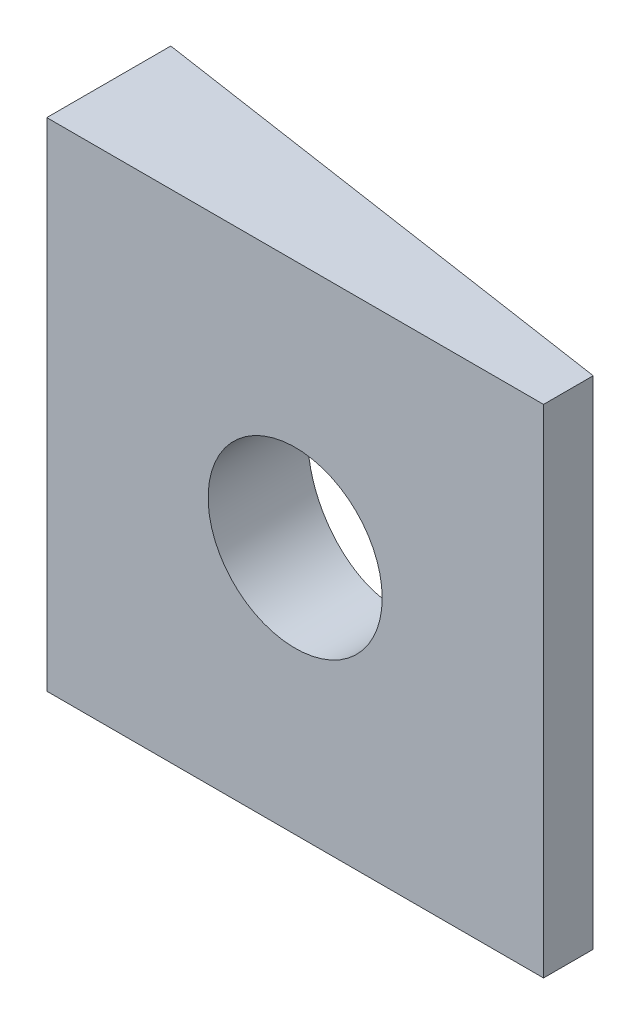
ISO-10303-21;
HEADER;
FILE_DESCRIPTION(('STEP AP214'),'2;1');
FILE_NAME('part.step','',(''),(''),'','','');
FILE_SCHEMA(('AUTOMOTIVE_DESIGN { 1 0 10303 214 1 1 1 1 }'));
ENDSEC;
DATA;
#1=APPLICATION_CONTEXT('core data for automotive mechanical design processes');
#2=APPLICATION_PROTOCOL_DEFINITION('international standard','automotive_design',2000,#1);
#3=PRODUCT_CONTEXT('',#1,'mechanical');
#4=PRODUCT('Part','Part','',(#3));
#5=PRODUCT_RELATED_PRODUCT_CATEGORY('part','',(#4));
#6=PRODUCT_DEFINITION_FORMATION('','',#4);
#7=PRODUCT_DEFINITION_CONTEXT('part definition',#1,'design');
#8=PRODUCT_DEFINITION('design','',#6,#7);
#9=PRODUCT_DEFINITION_SHAPE('','',#8);
#10=(LENGTH_UNIT() NAMED_UNIT(*) SI_UNIT(.MILLI.,.METRE.));
#11=(NAMED_UNIT(*) PLANE_ANGLE_UNIT() SI_UNIT($,.RADIAN.));
#12=(NAMED_UNIT(*) SI_UNIT($,.STERADIAN.) SOLID_ANGLE_UNIT());
#13=UNCERTAINTY_MEASURE_WITH_UNIT(LENGTH_MEASURE(1.E-05),#10,'distance_accuracy_value','');
#14=(GEOMETRIC_REPRESENTATION_CONTEXT(3) GLOBAL_UNCERTAINTY_ASSIGNED_CONTEXT((#13)) GLOBAL_UNIT_ASSIGNED_CONTEXT((#10,
#11,#12)) REPRESENTATION_CONTEXT('',''));
#15=CARTESIAN_POINT('',(0.,0.,0.));
#16=DIRECTION('',(0.,0.,1.));
#17=DIRECTION('',(1.,0.,0.));
#18=AXIS2_PLACEMENT_3D('',#15,#16,#17);
#19=CARTESIAN_POINT('',(15.875,15.875,0.));
#20=DIRECTION('',(-1.,0.,0.));
#21=DIRECTION('',(0.,0.,1.));
#22=AXIS2_PLACEMENT_3D('',#19,#20,#21);
#23=PLANE('',#22);
#24=DIRECTION('',(0.,0.,-1.));
#25=VECTOR('',#24,1.);
#26=CARTESIAN_POINT('',(15.875,-15.875,0.));
#27=LINE('',#26,#25);
#28=CARTESIAN_POINT('',(15.875,-15.875,0.));
#29=VERTEX_POINT('',#28);
#30=CARTESIAN_POINT('',(15.875,-15.875,-3.175));
#31=VERTEX_POINT('',#30);
#32=EDGE_CURVE('E95',#29,#31,#27,.T.);
#33=ORIENTED_EDGE('',*,*,#32,.T.);
#34=DIRECTION('',(0.,-1.,0.));
#35=VECTOR('',#34,1.);
#36=CARTESIAN_POINT('',(15.875,15.875,-3.175));
#37=LINE('',#36,#35);
#38=CARTESIAN_POINT('',(15.875,15.875,-3.175));
#39=VERTEX_POINT('',#38);
#40=EDGE_CURVE('E11',#39,#31,#37,.T.);
#41=ORIENTED_EDGE('',*,*,#40,.F.);
#42=DIRECTION('',(0.,0.,-1.));
#43=VECTOR('',#42,1.);
#44=CARTESIAN_POINT('',(15.875,15.875,0.));
#45=LINE('',#44,#43);
#46=CARTESIAN_POINT('',(15.875,15.875,0.));
#47=VERTEX_POINT('',#46);
#48=EDGE_CURVE('E83',#47,#39,#45,.T.);
#49=ORIENTED_EDGE('',*,*,#48,.F.);
#50=DIRECTION('',(0.,-1.,0.));
#51=VECTOR('',#50,1.);
#52=CARTESIAN_POINT('',(15.875,15.875,0.));
#53=LINE('',#52,#51);
#54=EDGE_CURVE('E91',#47,#29,#53,.T.);
#55=ORIENTED_EDGE('',*,*,#54,.T.);
#56=EDGE_LOOP('',(#33,#41,#49,#55));
#57=FACE_BOUND('',#56,.T.);
#58=ADVANCED_FACE('F32',(#57),#23,.F.);
#59=CARTESIAN_POINT('',(15.875,15.875,-3.175));
#60=DIRECTION('',(-0.147953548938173,0.,0.988994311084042));
#61=DIRECTION('',(0.988994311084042,0.,0.147953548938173));
#62=AXIS2_PLACEMENT_3D('',#59,#60,#61);
#63=PLANE('',#62);
#64=CARTESIAN_POINT('',(0.,0.,-5.5499));
#65=DIRECTION('',(-0.147953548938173,0.,0.988994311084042));
#66=DIRECTION('',(0.988994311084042,0.,0.147953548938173));
#67=AXIS2_PLACEMENT_3D('',#64,#65,#66);
#68=ELLIPSE('',#67,5.62450151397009,5.5626);
#69=CARTESIAN_POINT('',(5.5626,0.,-4.71773504));
#70=VERTEX_POINT('',#69);
#71=EDGE_CURVE('E98',#70,#70,#68,.T.);
#72=ORIENTED_EDGE('',*,*,#71,.T.);
#73=EDGE_LOOP('',(#72));
#74=FACE_BOUND('',#73,.T.);
#75=DIRECTION('',(-0.988994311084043,0.,-0.147953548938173));
#76=VECTOR('',#75,1.);
#77=CARTESIAN_POINT('',(15.875,-15.875,-3.175));
#78=LINE('',#77,#76);
#79=CARTESIAN_POINT('',(-15.875,-15.875,-7.9248));
#80=VERTEX_POINT('',#79);
#81=EDGE_CURVE('E87',#31,#80,#78,.T.);
#82=ORIENTED_EDGE('',*,*,#81,.T.);
#83=DIRECTION('',(0.,-1.,0.));
#84=VECTOR('',#83,1.);
#85=CARTESIAN_POINT('',(-15.875,15.875,-7.9248));
#86=LINE('',#85,#84);
#87=CARTESIAN_POINT('',(-15.875,15.875,-7.9248));
#88=VERTEX_POINT('',#87);
#89=EDGE_CURVE('E40',#88,#80,#86,.T.);
#90=ORIENTED_EDGE('',*,*,#89,.F.);
#91=DIRECTION('',(-0.988994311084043,0.,-0.147953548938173));
#92=VECTOR('',#91,1.);
#93=CARTESIAN_POINT('',(15.875,15.875,-3.175));
#94=LINE('',#93,#92);
#95=EDGE_CURVE('E78',#39,#88,#94,.T.);
#96=ORIENTED_EDGE('',*,*,#95,.F.);
#97=ORIENTED_EDGE('',*,*,#40,.T.);
#98=EDGE_LOOP('',(#82,#90,#96,#97));
#99=FACE_BOUND('',#98,.T.);
#100=ADVANCED_FACE('F86',(#74,#99),#63,.F.);
#101=CARTESIAN_POINT('',(-15.875,15.875,-7.9248));
#102=DIRECTION('',(1.,0.,0.));
#103=DIRECTION('',(0.,0.,-1.));
#104=AXIS2_PLACEMENT_3D('',#101,#102,#103);
#105=PLANE('',#104);
#106=DIRECTION('',(0.,0.,1.));
#107=VECTOR('',#106,1.);
#108=CARTESIAN_POINT('',(-15.875,-15.875,-7.9248));
#109=LINE('',#108,#107);
#110=CARTESIAN_POINT('',(-15.875,-15.875,0.));
#111=VERTEX_POINT('',#110);
#112=EDGE_CURVE('E65',#80,#111,#109,.T.);
#113=ORIENTED_EDGE('',*,*,#112,.T.);
#114=DIRECTION('',(0.,-1.,0.));
#115=VECTOR('',#114,1.);
#116=CARTESIAN_POINT('',(-15.875,15.875,0.));
#117=LINE('',#116,#115);
#118=CARTESIAN_POINT('',(-15.875,15.875,0.));
#119=VERTEX_POINT('',#118);
#120=EDGE_CURVE('E88',#119,#111,#117,.T.);
#121=ORIENTED_EDGE('',*,*,#120,.F.);
#122=DIRECTION('',(0.,0.,1.));
#123=VECTOR('',#122,1.);
#124=CARTESIAN_POINT('',(-15.875,15.875,-7.9248));
#125=LINE('',#124,#123);
#126=EDGE_CURVE('E81',#88,#119,#125,.T.);
#127=ORIENTED_EDGE('',*,*,#126,.F.);
#128=ORIENTED_EDGE('',*,*,#89,.T.);
#129=EDGE_LOOP('',(#113,#121,#127,#128));
#130=FACE_BOUND('',#129,.T.);
#131=ADVANCED_FACE('F89',(#130),#105,.F.);
#132=CARTESIAN_POINT('',(-15.875,15.875,0.));
#133=DIRECTION('',(0.,0.,-1.));
#134=DIRECTION('',(-1.,0.,0.));
#135=AXIS2_PLACEMENT_3D('',#132,#133,#134);
#136=PLANE('',#135);
#137=CARTESIAN_POINT('',(0.,0.,0.));
#138=DIRECTION('',(0.,0.,1.));
#139=DIRECTION('',(1.,0.,0.));
#140=AXIS2_PLACEMENT_3D('',#137,#138,#139);
#141=CIRCLE('',#140,5.5626);
#142=CARTESIAN_POINT('',(5.5626,0.,0.));
#143=VERTEX_POINT('',#142);
#144=EDGE_CURVE('E111',#143,#143,#141,.T.);
#145=ORIENTED_EDGE('',*,*,#144,.F.);
#146=EDGE_LOOP('',(#145));
#147=FACE_BOUND('',#146,.T.);
#148=DIRECTION('',(1.,0.,0.));
#149=VECTOR('',#148,1.);
#150=CARTESIAN_POINT('',(-15.875,-15.875,0.));
#151=LINE('',#150,#149);
#152=EDGE_CURVE('E71',#111,#29,#151,.T.);
#153=ORIENTED_EDGE('',*,*,#152,.T.);
#154=ORIENTED_EDGE('',*,*,#54,.F.);
#155=DIRECTION('',(1.,0.,0.));
#156=VECTOR('',#155,1.);
#157=CARTESIAN_POINT('',(-15.875,15.875,0.));
#158=LINE('',#157,#156);
#159=EDGE_CURVE('E48',#119,#47,#158,.T.);
#160=ORIENTED_EDGE('',*,*,#159,.F.);
#161=ORIENTED_EDGE('',*,*,#120,.T.);
#162=EDGE_LOOP('',(#153,#154,#160,#161));
#163=FACE_BOUND('',#162,.T.);
#164=ADVANCED_FACE('F103',(#147,#163),#136,.F.);
#165=CARTESIAN_POINT('',(15.875,15.875,0.));
#166=DIRECTION('',(0.,-1.,0.));
#167=DIRECTION('',(0.,0.,-1.));
#168=AXIS2_PLACEMENT_3D('',#165,#166,#167);
#169=PLANE('',#168);
#170=ORIENTED_EDGE('',*,*,#48,.T.);
#171=ORIENTED_EDGE('',*,*,#95,.T.);
#172=ORIENTED_EDGE('',*,*,#126,.T.);
#173=ORIENTED_EDGE('',*,*,#159,.T.);
#174=EDGE_LOOP('',(#170,#171,#172,#173));
#175=FACE_BOUND('',#174,.T.);
#176=ADVANCED_FACE('F79',(#175),#169,.F.);
#177=CARTESIAN_POINT('',(15.875,-15.875,0.));
#178=DIRECTION('',(0.,-1.,0.));
#179=DIRECTION('',(0.,0.,-1.));
#180=AXIS2_PLACEMENT_3D('',#177,#178,#179);
#181=PLANE('',#180);
#182=ORIENTED_EDGE('',*,*,#32,.F.);
#183=ORIENTED_EDGE('',*,*,#152,.F.);
#184=ORIENTED_EDGE('',*,*,#112,.F.);
#185=ORIENTED_EDGE('',*,*,#81,.F.);
#186=EDGE_LOOP('',(#182,#183,#184,#185));
#187=FACE_BOUND('',#186,.T.);
#188=ADVANCED_FACE('F106',(#187),#181,.T.);
#189=CARTESIAN_POINT('',(0.,0.,-7.9248));
#190=DIRECTION('',(0.,0.,1.));
#191=DIRECTION('',(1.,0.,0.));
#192=AXIS2_PLACEMENT_3D('',#189,#190,#191);
#193=CYLINDRICAL_SURFACE('',#192,5.5626);
#194=ORIENTED_EDGE('',*,*,#144,.T.);
#195=EDGE_LOOP('',(#194));
#196=FACE_BOUND('',#195,.T.);
#197=ORIENTED_EDGE('',*,*,#71,.F.);
#198=EDGE_LOOP('',(#197));
#199=FACE_BOUND('',#198,.T.);
#200=ADVANCED_FACE('F115',(#196,#199),#193,.F.);
#201=CLOSED_SHELL('',(#58,#100,#131,#164,#176,#188,#200));
#202=MANIFOLD_SOLID_BREP('B2',#201);
#203=ADVANCED_BREP_SHAPE_REPRESENTATION('',(#18,#202),#14);
#204=SHAPE_DEFINITION_REPRESENTATION(#9,#203);
ENDSEC;
END-ISO-10303-21;
